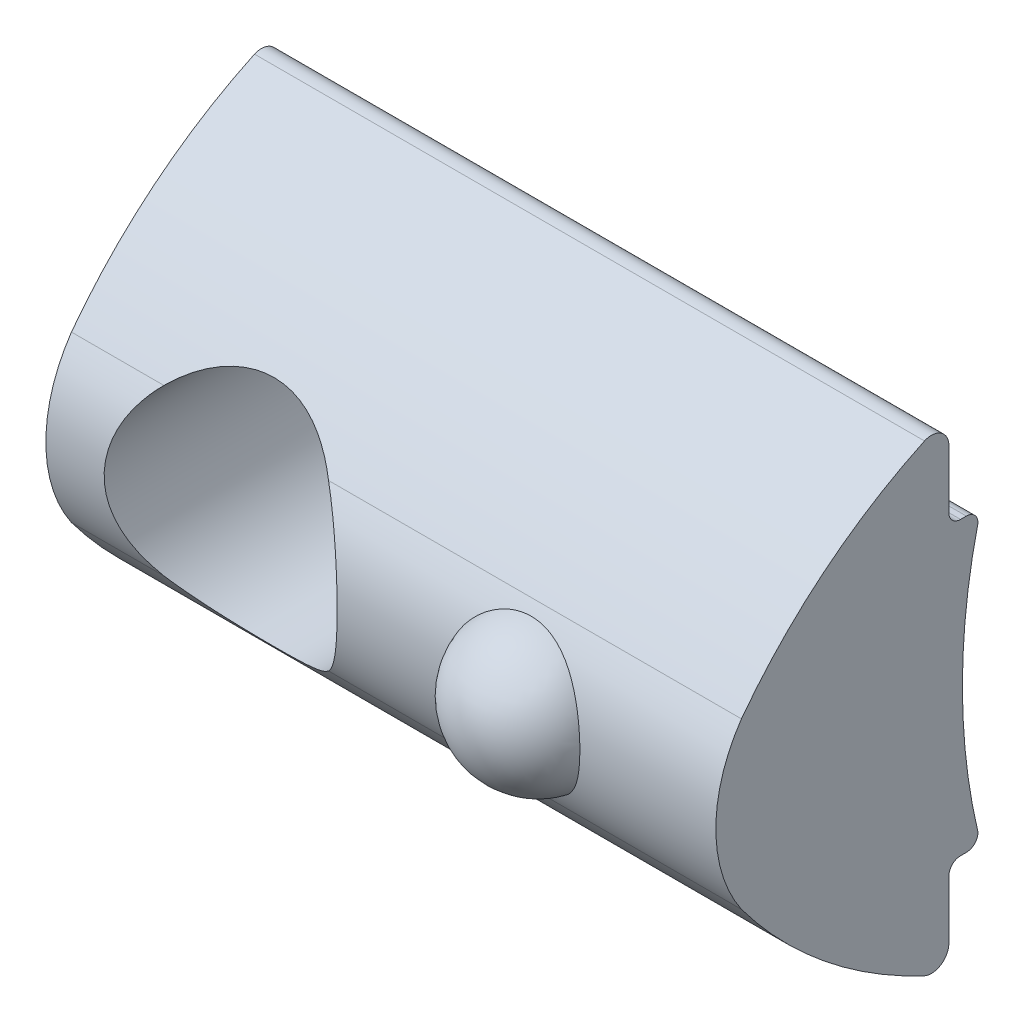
ISO-10303-21;
HEADER;
FILE_DESCRIPTION(('STEP AP214'),'2;1');
FILE_NAME('part.step','',(''),(''),'','','');
FILE_SCHEMA(('AUTOMOTIVE_DESIGN { 1 0 10303 214 1 1 1 1 }'));
ENDSEC;
DATA;
#1=APPLICATION_CONTEXT('core data for automotive mechanical design processes');
#2=APPLICATION_PROTOCOL_DEFINITION('international standard','automotive_design',2000,#1);
#3=PRODUCT_CONTEXT('',#1,'mechanical');
#4=PRODUCT('Part','Part','',(#3));
#5=PRODUCT_RELATED_PRODUCT_CATEGORY('part','',(#4));
#6=PRODUCT_DEFINITION_FORMATION('','',#4);
#7=PRODUCT_DEFINITION_CONTEXT('part definition',#1,'design');
#8=PRODUCT_DEFINITION('design','',#6,#7);
#9=PRODUCT_DEFINITION_SHAPE('','',#8);
#10=(LENGTH_UNIT() NAMED_UNIT(*) SI_UNIT(.MILLI.,.METRE.));
#11=(NAMED_UNIT(*) PLANE_ANGLE_UNIT() SI_UNIT($,.RADIAN.));
#12=(NAMED_UNIT(*) SI_UNIT($,.STERADIAN.) SOLID_ANGLE_UNIT());
#13=UNCERTAINTY_MEASURE_WITH_UNIT(LENGTH_MEASURE(1.E-05),#10,'distance_accuracy_value','');
#14=(GEOMETRIC_REPRESENTATION_CONTEXT(3) GLOBAL_UNCERTAINTY_ASSIGNED_CONTEXT((#13)) GLOBAL_UNIT_ASSIGNED_CONTEXT((#10,
#11,#12)) REPRESENTATION_CONTEXT('',''));
#15=CARTESIAN_POINT('',(0.,0.,0.));
#16=DIRECTION('',(0.,0.,1.));
#17=DIRECTION('',(1.,0.,0.));
#18=AXIS2_PLACEMENT_3D('',#15,#16,#17);
#19=CARTESIAN_POINT('',(8.5,1.17961196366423E-13,1.5000000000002));
#20=DIRECTION('',(-1.,0.,0.));
#21=DIRECTION('',(0.,1.,0.));
#22=AXIS2_PLACEMENT_3D('',#19,#20,#21);
#23=CYLINDRICAL_SURFACE('',#22,2.5);
#24=DIRECTION('',(-1.,0.,0.));
#25=VECTOR('',#24,1.);
#26=CARTESIAN_POINT('',(8.5,-1.41554648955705,3.56063779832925));
#27=LINE('',#26,#25);
#28=CARTESIAN_POINT('',(-1.41287937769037,-1.41554648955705,3.56063779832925));
#29=VERTEX_POINT('',#28);
#30=CARTESIAN_POINT('',(-3.,-1.41554648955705,3.56063779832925));
#31=VERTEX_POINT('',#30);
#32=EDGE_CURVE('E155',#29,#31,#27,.T.);
#33=ORIENTED_EDGE('',*,*,#32,.F.);
#34=CARTESIAN_POINT('',(-1.41287937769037,-1.41554648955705,3.56063779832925));
#35=CARTESIAN_POINT('',(-1.44943985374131,-1.37904113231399,3.58571280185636));
#36=CARTESIAN_POINT('',(-1.48471509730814,-1.34101538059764,3.61040711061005));
#37=CARTESIAN_POINT('',(-1.5525583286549,-1.26186190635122,3.65867122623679));
#38=CARTESIAN_POINT('',(-1.58512301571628,-1.22073051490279,3.68223964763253));
#39=CARTESIAN_POINT('',(-1.678779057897,-1.09222765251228,3.75088495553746));
#40=CARTESIAN_POINT('',(-1.73540310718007,-1.0001712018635,3.79360120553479));
#41=CARTESIAN_POINT('',(-1.82636478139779,-0.820297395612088,3.8632392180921));
#42=CARTESIAN_POINT('',(-1.86280818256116,-0.734097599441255,3.89158913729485));
#43=CARTESIAN_POINT('',(-1.92364463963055,-0.555388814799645,3.93927258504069));
#44=CARTESIAN_POINT('',(-1.94807293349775,-0.462899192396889,3.95863247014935));
#45=CARTESIAN_POINT('',(-1.98362135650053,-0.273158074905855,3.98689277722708));
#46=CARTESIAN_POINT('',(-1.99465414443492,-0.175879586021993,3.99572454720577));
#47=CARTESIAN_POINT('',(-2.00229419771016,0.0196619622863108,4.00183446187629));
#48=CARTESIAN_POINT('',(-1.99889661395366,0.117925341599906,3.99910872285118));
#49=CARTESIAN_POINT('',(-1.97894237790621,0.302644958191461,3.98318011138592));
#50=CARTESIAN_POINT('',(-1.96366790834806,0.389335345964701,3.97099828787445));
#51=CARTESIAN_POINT('',(-1.92242018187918,0.558461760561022,3.9383479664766));
#52=CARTESIAN_POINT('',(-1.89644686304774,0.64089776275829,3.91787942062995));
#53=CARTESIAN_POINT('',(-1.83332986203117,0.804366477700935,3.86868858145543));
#54=CARTESIAN_POINT('',(-1.79564782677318,0.885069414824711,3.83957240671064));
#55=CARTESIAN_POINT('',(-1.71118646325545,1.03901823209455,3.77539094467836));
#56=CARTESIAN_POINT('',(-1.66440121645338,1.11225921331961,3.74032178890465));
#57=CARTESIAN_POINT('',(-1.58293949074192,1.22352893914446,3.6806553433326));
#58=CARTESIAN_POINT('',(-1.55071565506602,1.26409726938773,3.65734892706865));
#59=CARTESIAN_POINT('',(-1.48369538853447,1.34211640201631,3.60969341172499));
#60=CARTESIAN_POINT('',(-1.44890787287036,1.37957712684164,3.58534803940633));
#61=CARTESIAN_POINT('',(-1.4128793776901,1.41554648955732,3.56063779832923));
#62=B_SPLINE_CURVE_WITH_KNOTS('',3,(#34,#35,#36,#37,#38,#39,#40,#41,#42,#43,#44,#45,#46,#47,#48,
#49,#50,#51,#52,#53,#54,#55,#56,#57,#58,#59,#60,#61),.UNSPECIFIED.,.F.,.F.,(4,2,2,2,2,2,2,2,2,2,
2,2,2,4),(0.,0.172205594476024,0.344617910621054,0.691443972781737,0.983621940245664,
1.27493781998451,1.568143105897,1.86144692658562,2.12685696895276,2.39226854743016,
2.67235932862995,2.95263282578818,3.12292431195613,3.29264926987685),.UNSPECIFIED.);
#63=CARTESIAN_POINT('',(-1.4128793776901,1.41554648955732,3.56063779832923));
#64=VERTEX_POINT('',#63);
#65=EDGE_CURVE('E35',#29,#64,#62,.T.);
#66=ORIENTED_EDGE('',*,*,#65,.T.);
#67=DIRECTION('',(-1.,0.,0.));
#68=VECTOR('',#67,1.);
#69=CARTESIAN_POINT('',(8.5,1.41554648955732,3.56063779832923));
#70=LINE('',#69,#68);
#71=CARTESIAN_POINT('',(-3.,1.41554648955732,3.56063779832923));
#72=VERTEX_POINT('',#71);
#73=EDGE_CURVE('E199',#64,#72,#70,.T.);
#74=ORIENTED_EDGE('',*,*,#73,.T.);
#75=CARTESIAN_POINT('',(-3.,1.17961196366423E-13,1.5000000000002));
#76=DIRECTION('',(1.,0.,0.));
#77=DIRECTION('',(0.,-1.,0.));
#78=AXIS2_PLACEMENT_3D('',#75,#76,#77);
#79=CIRCLE('',#78,2.5);
#80=EDGE_CURVE('E187',#72,#31,#79,.T.);
#81=ORIENTED_EDGE('',*,*,#80,.T.);
#82=EDGE_LOOP('',(#33,#66,#74,#81));
#83=FACE_BOUND('',#82,.T.);
#84=ADVANCED_FACE('F14',(#83),#23,.T.);
#85=CARTESIAN_POINT('',(8.5,-2.69999999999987,-0.199999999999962));
#86=DIRECTION('',(-1.,0.,0.));
#87=DIRECTION('',(0.,1.,0.));
#88=AXIS2_PLACEMENT_3D('',#85,#86,#87);
#89=CYLINDRICAL_SURFACE('',#88,0.2);
#90=CARTESIAN_POINT('',(-3.,-2.69999999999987,-0.199999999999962));
#91=DIRECTION('',(-1.,0.,0.));
#92=DIRECTION('',(0.,-1.,0.));
#93=AXIS2_PLACEMENT_3D('',#90,#91,#92);
#94=CIRCLE('',#93,0.2);
#95=CARTESIAN_POINT('',(-3.,-2.69999999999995,0.));
#96=VERTEX_POINT('',#95);
#97=CARTESIAN_POINT('',(-3.,-2.49999999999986,-0.199999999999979));
#98=VERTEX_POINT('',#97);
#99=EDGE_CURVE('E164',#96,#98,#94,.T.);
#100=ORIENTED_EDGE('',*,*,#99,.T.);
#101=DIRECTION('',(-1.,0.,0.));
#102=VECTOR('',#101,1.);
#103=CARTESIAN_POINT('',(8.5,-2.49999999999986,-0.199999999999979));
#104=LINE('',#103,#102);
#105=CARTESIAN_POINT('',(8.5,-2.49999999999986,-0.199999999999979));
#106=VERTEX_POINT('',#105);
#107=EDGE_CURVE('E28',#106,#98,#104,.T.);
#108=ORIENTED_EDGE('',*,*,#107,.F.);
#109=CARTESIAN_POINT('',(8.5,-2.69999999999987,-0.199999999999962));
#110=DIRECTION('',(-1.,0.,0.));
#111=DIRECTION('',(0.,-1.,0.));
#112=AXIS2_PLACEMENT_3D('',#109,#110,#111);
#113=CIRCLE('',#112,0.2);
#114=CARTESIAN_POINT('',(8.5,-2.69999999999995,0.));
#115=VERTEX_POINT('',#114);
#116=EDGE_CURVE('E194',#115,#106,#113,.T.);
#117=ORIENTED_EDGE('',*,*,#116,.F.);
#118=DIRECTION('',(-1.,0.,0.));
#119=VECTOR('',#118,1.);
#120=CARTESIAN_POINT('',(8.5,-2.69999999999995,0.));
#121=LINE('',#120,#119);
#122=EDGE_CURVE('E160',#115,#96,#121,.T.);
#123=ORIENTED_EDGE('',*,*,#122,.T.);
#124=EDGE_LOOP('',(#100,#108,#117,#123));
#125=FACE_BOUND('',#124,.T.);
#126=ADVANCED_FACE('F16',(#125),#89,.F.);
#127=CARTESIAN_POINT('',(8.5,-2.49999999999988,-0.299999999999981));
#128=DIRECTION('',(0.,1.,-1.45726178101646E-13));
#129=DIRECTION('',(0.,1.45726178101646E-13,1.));
#130=AXIS2_PLACEMENT_3D('',#127,#128,#129);
#131=PLANE('',#130);
#132=DIRECTION('',(0.,-1.45726178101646E-13,-1.));
#133=VECTOR('',#132,1.);
#134=CARTESIAN_POINT('',(-3.,-2.49999999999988,-0.299999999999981));
#135=LINE('',#134,#133);
#136=CARTESIAN_POINT('',(-3.,-2.49999999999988,-0.299999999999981));
#137=VERTEX_POINT('',#136);
#138=EDGE_CURVE('E167',#98,#137,#135,.T.);
#139=ORIENTED_EDGE('',*,*,#138,.T.);
#140=DIRECTION('',(-1.,0.,0.));
#141=VECTOR('',#140,1.);
#142=CARTESIAN_POINT('',(8.5,-2.49999999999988,-0.299999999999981));
#143=LINE('',#142,#141);
#144=CARTESIAN_POINT('',(8.5,-2.49999999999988,-0.299999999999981));
#145=VERTEX_POINT('',#144);
#146=EDGE_CURVE('E224',#145,#137,#143,.T.);
#147=ORIENTED_EDGE('',*,*,#146,.F.);
#148=DIRECTION('',(0.,-1.45726178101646E-13,-1.));
#149=VECTOR('',#148,1.);
#150=CARTESIAN_POINT('',(8.5,-2.49999999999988,-0.299999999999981));
#151=LINE('',#150,#149);
#152=EDGE_CURVE('E103',#106,#145,#151,.T.);
#153=ORIENTED_EDGE('',*,*,#152,.F.);
#154=ORIENTED_EDGE('',*,*,#107,.T.);
#155=EDGE_LOOP('',(#139,#147,#153,#154));
#156=FACE_BOUND('',#155,.T.);
#157=ADVANCED_FACE('F305',(#156),#131,.F.);
#158=CARTESIAN_POINT('',(8.5,-2.29999999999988,-0.29999999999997));
#159=DIRECTION('',(-1.,0.,0.));
#160=DIRECTION('',(0.,1.,0.));
#161=AXIS2_PLACEMENT_3D('',#158,#159,#160);
#162=CYLINDRICAL_SURFACE('',#161,0.2);
#163=CARTESIAN_POINT('',(-3.,-2.29999999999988,-0.29999999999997));
#164=DIRECTION('',(1.,0.,0.));
#165=DIRECTION('',(0.,-1.,0.));
#166=AXIS2_PLACEMENT_3D('',#163,#164,#165);
#167=CIRCLE('',#166,0.2);
#168=CARTESIAN_POINT('',(-3.,-2.29999999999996,-0.499999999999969));
#169=VERTEX_POINT('',#168);
#170=EDGE_CURVE('E170',#137,#169,#167,.T.);
#171=ORIENTED_EDGE('',*,*,#170,.T.);
#172=DIRECTION('',(-1.,0.,0.));
#173=VECTOR('',#172,1.);
#174=CARTESIAN_POINT('',(8.5,-2.29999999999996,-0.499999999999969));
#175=LINE('',#174,#173);
#176=CARTESIAN_POINT('',(8.5,-2.29999999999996,-0.499999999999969));
#177=VERTEX_POINT('',#176);
#178=EDGE_CURVE('E221',#177,#169,#175,.T.);
#179=ORIENTED_EDGE('',*,*,#178,.F.);
#180=CARTESIAN_POINT('',(8.5,-2.29999999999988,-0.29999999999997));
#181=DIRECTION('',(1.,0.,0.));
#182=DIRECTION('',(0.,-1.,0.));
#183=AXIS2_PLACEMENT_3D('',#180,#181,#182);
#184=CIRCLE('',#183,0.2);
#185=EDGE_CURVE('E343',#145,#177,#184,.T.);
#186=ORIENTED_EDGE('',*,*,#185,.F.);
#187=ORIENTED_EDGE('',*,*,#146,.T.);
#188=EDGE_LOOP('',(#171,#179,#186,#187));
#189=FACE_BOUND('',#188,.T.);
#190=ADVANCED_FACE('F302',(#189),#162,.T.);
#191=CARTESIAN_POINT('',(8.5,0.,-10.2319062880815));
#192=DIRECTION('',(-1.,0.,0.));
#193=DIRECTION('',(0.,1.,0.));
#194=AXIS2_PLACEMENT_3D('',#191,#192,#193);
#195=CYLINDRICAL_SURFACE('',#194,10.);
#196=CARTESIAN_POINT('',(0.,2.,-0.433947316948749));
#197=CARTESIAN_POINT('',(-0.111128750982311,1.99999589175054,-0.433945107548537));
#198=CARTESIAN_POINT('',(-0.222309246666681,1.99070634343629,-0.43203612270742));
#199=CARTESIAN_POINT('',(-0.441525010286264,1.95382456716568,-0.424617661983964));
#200=CARTESIAN_POINT('',(-0.54955768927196,1.92621769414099,-0.419105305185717));
#201=CARTESIAN_POINT('',(-0.759274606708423,1.85359156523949,-0.405128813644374));
#202=CARTESIAN_POINT('',(-0.86096504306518,1.80858962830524,-0.396667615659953));
#203=CARTESIAN_POINT('',(-1.05534968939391,1.70249821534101,-0.377750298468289));
#204=CARTESIAN_POINT('',(-1.14804440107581,1.6414096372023,-0.367294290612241));
#205=CARTESIAN_POINT('',(-1.32312200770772,1.50395815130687,-0.34540029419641));
#206=CARTESIAN_POINT('',(-1.40535917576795,1.42741131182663,-0.33395153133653));
#207=CARTESIAN_POINT('',(-1.55591506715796,1.26161357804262,-0.31145684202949));
#208=CARTESIAN_POINT('',(-1.62423281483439,1.17236179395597,-0.300410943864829));
#209=CARTESIAN_POINT('',(-1.74557603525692,0.982722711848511,-0.279850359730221));
#210=CARTESIAN_POINT('',(-1.79846302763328,0.882245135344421,-0.270349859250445));
#211=CARTESIAN_POINT('',(-1.88654987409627,0.673608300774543,-0.254071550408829));
#212=CARTESIAN_POINT('',(-1.92175138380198,0.565449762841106,-0.247293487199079));
#213=CARTESIAN_POINT('',(-1.97301438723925,0.346033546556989,-0.237299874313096));
#214=CARTESIAN_POINT('',(-1.98932195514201,0.234835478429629,-0.23403856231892));
#215=CARTESIAN_POINT('',(-2.00310190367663,0.0112371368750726,-0.231287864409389));
#216=CARTESIAN_POINT('',(-2.00057609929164,-0.101163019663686,-0.231798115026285));
#217=CARTESIAN_POINT('',(-1.97694763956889,-0.322284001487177,-0.236497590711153));
#218=CARTESIAN_POINT('',(-1.9561100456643,-0.431034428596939,-0.240634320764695));
#219=CARTESIAN_POINT('',(-1.89686993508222,-0.643463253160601,-0.252062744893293));
#220=CARTESIAN_POINT('',(-1.85846671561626,-0.747141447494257,-0.259354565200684));
#221=CARTESIAN_POINT('',(-1.76493991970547,-0.947238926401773,-0.276360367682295));
#222=CARTESIAN_POINT('',(-1.70971249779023,-1.0436083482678,-0.28608932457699));
#223=CARTESIAN_POINT('',(-1.5841818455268,-1.22581009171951,-0.306896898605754));
#224=CARTESIAN_POINT('',(-1.51387688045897,-1.31164119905,-0.317975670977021));
#225=CARTESIAN_POINT('',(-1.35873275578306,-1.47190286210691,-0.340487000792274));
#226=CARTESIAN_POINT('',(-1.27366162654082,-1.54610863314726,-0.351922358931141));
#227=CARTESIAN_POINT('',(-1.0921671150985,-1.67923698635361,-0.373674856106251));
#228=CARTESIAN_POINT('',(-0.995743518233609,-1.7381592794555,-0.383991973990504));
#229=CARTESIAN_POINT('',(-0.79395833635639,-1.83912562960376,-0.402345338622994));
#230=CARTESIAN_POINT('',(-0.688578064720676,-1.88113329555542,-0.410376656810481));
#231=CARTESIAN_POINT('',(-0.472057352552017,-1.94678068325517,-0.423176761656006));
#232=CARTESIAN_POINT('',(-0.360917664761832,-1.97042279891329,-0.427945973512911));
#233=CARTESIAN_POINT('',(-0.138070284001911,-1.9983320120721,-0.433596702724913));
#234=CARTESIAN_POINT('',(-0.026404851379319,-2.00292371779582,-0.434543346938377));
#235=CARTESIAN_POINT('',(0.196096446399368,-1.99347525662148,-0.432616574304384));
#236=CARTESIAN_POINT('',(0.306932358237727,-1.97943614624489,-0.429743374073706));
#237=CARTESIAN_POINT('',(0.523537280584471,-1.93340441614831,-0.420561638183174));
#238=CARTESIAN_POINT('',(0.629344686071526,-1.9015852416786,-0.414286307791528));
#239=CARTESIAN_POINT('',(0.834126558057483,-1.82108207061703,-0.399036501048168));
#240=CARTESIAN_POINT('',(0.933100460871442,-1.77239668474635,-0.390061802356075));
#241=CARTESIAN_POINT('',(1.12282621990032,-1.6588082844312,-0.370278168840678));
#242=CARTESIAN_POINT('',(1.21345409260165,-1.59370215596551,-0.359446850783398));
#243=CARTESIAN_POINT('',(1.38261662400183,-1.44939114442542,-0.337231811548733));
#244=CARTESIAN_POINT('',(1.46115003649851,-1.37018481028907,-0.325848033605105));
#245=CARTESIAN_POINT('',(1.60512511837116,-1.19846454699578,-0.303599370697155));
#246=CARTESIAN_POINT('',(1.67034730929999,-1.10576499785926,-0.292745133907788));
#247=CARTESIAN_POINT('',(1.78429176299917,-0.910535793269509,-0.272963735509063));
#248=CARTESIAN_POINT('',(1.83301471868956,-0.808006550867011,-0.264036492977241));
#249=CARTESIAN_POINT('',(1.91225774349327,-0.596605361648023,-0.249160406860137));
#250=CARTESIAN_POINT('',(1.94288103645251,-0.487773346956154,-0.243194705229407));
#251=CARTESIAN_POINT('',(1.98538249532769,-0.266378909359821,-0.234841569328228));
#252=CARTESIAN_POINT('',(1.99726291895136,-0.153816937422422,-0.232453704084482));
#253=CARTESIAN_POINT('',(2.00185396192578,0.0697457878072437,-0.231535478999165));
#254=CARTESIAN_POINT('',(1.99489456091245,0.180739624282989,-0.232938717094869));
#255=CARTESIAN_POINT('',(1.96273209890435,0.399942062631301,-0.239305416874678));
#256=CARTESIAN_POINT('',(1.93752926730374,0.508150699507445,-0.244268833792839));
#257=CARTESIAN_POINT('',(1.86974201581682,0.71850549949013,-0.257196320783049));
#258=CARTESIAN_POINT('',(1.82719724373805,0.820664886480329,-0.265153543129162));
#259=CARTESIAN_POINT('',(1.72597551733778,1.01644244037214,-0.283211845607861));
#260=CARTESIAN_POINT('',(1.667297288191,1.11005993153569,-0.293313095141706));
#261=CARTESIAN_POINT('',(1.53436122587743,1.28772778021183,-0.314754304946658));
#262=CARTESIAN_POINT('',(1.45986732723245,1.37159943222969,-0.326111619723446));
#263=CARTESIAN_POINT('',(1.29789951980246,1.52576523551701,-0.348681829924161));
#264=CARTESIAN_POINT('',(1.21042254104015,1.59605616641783,-0.359894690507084));
#265=CARTESIAN_POINT('',(1.02384136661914,1.72178443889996,-0.381039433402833));
#266=CARTESIAN_POINT('',(0.924622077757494,1.77705362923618,-0.390956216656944));
#267=CARTESIAN_POINT('',(0.718134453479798,1.87004809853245,-0.4082015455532));
#268=CARTESIAN_POINT('',(0.610873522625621,1.90778929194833,-0.415532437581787));
#269=CARTESIAN_POINT('',(0.419475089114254,1.95733827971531,-0.425312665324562));
#270=CARTESIAN_POINT('',(0.336429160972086,1.97330779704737,-0.428530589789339));
#271=CARTESIAN_POINT('',(0.168932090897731,1.99464003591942,-0.432848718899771));
#272=CARTESIAN_POINT('',(0.0844809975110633,2.00000312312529,-0.433948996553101));
#273=CARTESIAN_POINT('',(0.,2.,-0.433947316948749));
#274=B_SPLINE_CURVE_WITH_KNOTS('',3,(#196,#197,#198,#199,#200,#201,#202,#203,#204,#205,#206,
#207,#208,#209,#210,#211,#212,#213,#214,#215,#216,#217,#218,#219,#220,#221,#222,#223,#224,#225,
#226,#227,#228,#229,#230,#231,#232,#233,#234,#235,#236,#237,#238,#239,#240,#241,#242,#243,#244,
#245,#246,#247,#248,#249,#250,#251,#252,#253,#254,#255,#256,#257,#258,#259,#260,#261,#262,#263,
#264,#265,#266,#267,#268,#269,#270,#271,#272,#273),.UNSPECIFIED.,.T.,.F.,(4,2,2,2,2,2,2,2,2,2,2,
2,2,2,2,2,2,2,2,2,2,2,2,2,2,2,2,2,2,2,2,2,2,2,2,2,2,2,4),(0.,0.333076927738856,
0.666420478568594,0.999432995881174,1.33242692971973,1.66964505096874,2.00688680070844,
2.347068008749,2.68721736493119,3.02288497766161,3.35852024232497,3.68937579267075,
4.020244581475,4.35319848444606,4.68619071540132,5.02498693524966,5.3637895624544,
5.70331726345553,6.04280070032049,6.37647515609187,6.71013069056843,7.04058683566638,
7.37107020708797,7.70586119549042,8.04068665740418,8.38065203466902,8.7206031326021,
9.058596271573,9.39654869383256,9.72862034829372,10.0606878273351,10.392000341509,
10.7233390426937,11.0600230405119,11.3967867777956,11.7371779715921,12.077259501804,
12.3304760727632,12.5836839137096),.UNSPECIFIED.);
#275=CARTESIAN_POINT('',(0.,2.,-0.433947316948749));
#276=VERTEX_POINT('',#275);
#277=EDGE_CURVE('E168',#276,#276,#274,.T.);
#278=ORIENTED_EDGE('',*,*,#277,.T.);
#279=EDGE_LOOP('',(#278));
#280=FACE_BOUND('',#279,.T.);
#281=CARTESIAN_POINT('',(-3.,0.,-10.2319062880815));
#282=DIRECTION('',(-1.,0.,0.));
#283=DIRECTION('',(0.,-1.,0.));
#284=AXIS2_PLACEMENT_3D('',#281,#282,#283);
#285=CIRCLE('',#284,10.);
#286=CARTESIAN_POINT('',(-3.,2.29999999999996,-0.499999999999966));
#287=VERTEX_POINT('',#286);
#288=EDGE_CURVE('E172',#169,#287,#285,.T.);
#289=ORIENTED_EDGE('',*,*,#288,.T.);
#290=DIRECTION('',(-1.,0.,0.));
#291=VECTOR('',#290,1.);
#292=CARTESIAN_POINT('',(8.5,2.29999999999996,-0.499999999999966));
#293=LINE('',#292,#291);
#294=CARTESIAN_POINT('',(8.5,2.29999999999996,-0.499999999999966));
#295=VERTEX_POINT('',#294);
#296=EDGE_CURVE('E218',#295,#287,#293,.T.);
#297=ORIENTED_EDGE('',*,*,#296,.F.);
#298=CARTESIAN_POINT('',(8.5,0.,-10.2319062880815));
#299=DIRECTION('',(-1.,0.,0.));
#300=DIRECTION('',(0.,-1.,0.));
#301=AXIS2_PLACEMENT_3D('',#298,#299,#300);
#302=CIRCLE('',#301,10.);
#303=EDGE_CURVE('E347',#177,#295,#302,.T.);
#304=ORIENTED_EDGE('',*,*,#303,.F.);
#305=ORIENTED_EDGE('',*,*,#178,.T.);
#306=EDGE_LOOP('',(#289,#297,#304,#305));
#307=FACE_BOUND('',#306,.T.);
#308=ADVANCED_FACE('F297',(#280,#307),#195,.F.);
#309=CARTESIAN_POINT('',(8.5,2.30000000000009,-0.299999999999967));
#310=DIRECTION('',(-1.,0.,0.));
#311=DIRECTION('',(0.,1.,0.));
#312=AXIS2_PLACEMENT_3D('',#309,#310,#311);
#313=CYLINDRICAL_SURFACE('',#312,0.2);
#314=CARTESIAN_POINT('',(-3.,2.30000000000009,-0.299999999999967));
#315=DIRECTION('',(1.,0.,0.));
#316=DIRECTION('',(0.,-1.,0.));
#317=AXIS2_PLACEMENT_3D('',#314,#315,#316);
#318=CIRCLE('',#317,0.2);
#319=CARTESIAN_POINT('',(-3.,2.5000000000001,-0.3));
#320=VERTEX_POINT('',#319);
#321=EDGE_CURVE('E174',#287,#320,#318,.T.);
#322=ORIENTED_EDGE('',*,*,#321,.T.);
#323=DIRECTION('',(-1.,0.,0.));
#324=VECTOR('',#323,1.);
#325=CARTESIAN_POINT('',(8.5,2.5000000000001,-0.3));
#326=LINE('',#325,#324);
#327=CARTESIAN_POINT('',(8.5,2.5000000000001,-0.3));
#328=VERTEX_POINT('',#327);
#329=EDGE_CURVE('E215',#328,#320,#326,.T.);
#330=ORIENTED_EDGE('',*,*,#329,.F.);
#331=CARTESIAN_POINT('',(8.5,2.30000000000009,-0.299999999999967));
#332=DIRECTION('',(1.,0.,0.));
#333=DIRECTION('',(0.,-1.,0.));
#334=AXIS2_PLACEMENT_3D('',#331,#332,#333);
#335=CIRCLE('',#334,0.2);
#336=EDGE_CURVE('E349',#295,#328,#335,.T.);
#337=ORIENTED_EDGE('',*,*,#336,.F.);
#338=ORIENTED_EDGE('',*,*,#296,.T.);
#339=EDGE_LOOP('',(#322,#330,#337,#338));
#340=FACE_BOUND('',#339,.T.);
#341=ADVANCED_FACE('F294',(#340),#313,.T.);
#342=CARTESIAN_POINT('',(8.5,2.5000000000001,-0.3));
#343=DIRECTION('',(0.,-1.,-1.49176812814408E-13));
#344=DIRECTION('',(0.,1.49176812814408E-13,-1.));
#345=AXIS2_PLACEMENT_3D('',#342,#343,#344);
#346=PLANE('',#345);
#347=DIRECTION('',(0.,-1.49176812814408E-13,1.));
#348=VECTOR('',#347,1.);
#349=CARTESIAN_POINT('',(-3.,2.5000000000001,-0.3));
#350=LINE('',#349,#348);
#351=CARTESIAN_POINT('',(-3.,2.50000000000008,-0.2));
#352=VERTEX_POINT('',#351);
#353=EDGE_CURVE('E176',#320,#352,#350,.T.);
#354=ORIENTED_EDGE('',*,*,#353,.T.);
#355=DIRECTION('',(-1.,0.,0.));
#356=VECTOR('',#355,1.);
#357=CARTESIAN_POINT('',(8.5,2.50000000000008,-0.2));
#358=LINE('',#357,#356);
#359=CARTESIAN_POINT('',(8.5,2.50000000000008,-0.2));
#360=VERTEX_POINT('',#359);
#361=EDGE_CURVE('E212',#360,#352,#358,.T.);
#362=ORIENTED_EDGE('',*,*,#361,.F.);
#363=DIRECTION('',(0.,-1.49176812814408E-13,1.));
#364=VECTOR('',#363,1.);
#365=CARTESIAN_POINT('',(8.5,2.5000000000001,-0.3));
#366=LINE('',#365,#364);
#367=EDGE_CURVE('E351',#328,#360,#366,.T.);
#368=ORIENTED_EDGE('',*,*,#367,.F.);
#369=ORIENTED_EDGE('',*,*,#329,.T.);
#370=EDGE_LOOP('',(#354,#362,#368,#369));
#371=FACE_BOUND('',#370,.T.);
#372=ADVANCED_FACE('F290',(#371),#346,.F.);
#373=CARTESIAN_POINT('',(8.5,2.70000000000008,-0.2));
#374=DIRECTION('',(-1.,0.,0.));
#375=DIRECTION('',(0.,1.,0.));
#376=AXIS2_PLACEMENT_3D('',#373,#374,#375);
#377=CYLINDRICAL_SURFACE('',#376,0.2);
#378=CARTESIAN_POINT('',(-3.,2.70000000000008,-0.2));
#379=DIRECTION('',(-1.,0.,0.));
#380=DIRECTION('',(0.,-1.,0.));
#381=AXIS2_PLACEMENT_3D('',#378,#379,#380);
#382=CIRCLE('',#381,0.2);
#383=CARTESIAN_POINT('',(-3.,2.70000000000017,0.));
#384=VERTEX_POINT('',#383);
#385=EDGE_CURVE('E178',#352,#384,#382,.T.);
#386=ORIENTED_EDGE('',*,*,#385,.T.);
#387=DIRECTION('',(-1.,0.,0.));
#388=VECTOR('',#387,1.);
#389=CARTESIAN_POINT('',(8.5,2.70000000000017,0.));
#390=LINE('',#389,#388);
#391=CARTESIAN_POINT('',(8.5,2.70000000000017,0.));
#392=VERTEX_POINT('',#391);
#393=EDGE_CURVE('E209',#392,#384,#390,.T.);
#394=ORIENTED_EDGE('',*,*,#393,.F.);
#395=CARTESIAN_POINT('',(8.5,2.70000000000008,-0.2));
#396=DIRECTION('',(-1.,0.,0.));
#397=DIRECTION('',(0.,-1.,0.));
#398=AXIS2_PLACEMENT_3D('',#395,#396,#397);
#399=CIRCLE('',#398,0.2);
#400=EDGE_CURVE('E353',#360,#392,#399,.T.);
#401=ORIENTED_EDGE('',*,*,#400,.F.);
#402=ORIENTED_EDGE('',*,*,#361,.T.);
#403=EDGE_LOOP('',(#386,#394,#401,#402));
#404=FACE_BOUND('',#403,.T.);
#405=ADVANCED_FACE('F286',(#404),#377,.F.);
#406=CARTESIAN_POINT('',(8.5,3.70000000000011,0.));
#407=DIRECTION('',(0.,0.,1.));
#408=DIRECTION('',(0.,-1.,0.));
#409=AXIS2_PLACEMENT_3D('',#406,#407,#408);
#410=PLANE('',#409);
#411=DIRECTION('',(0.,1.,0.));
#412=VECTOR('',#411,1.);
#413=CARTESIAN_POINT('',(-3.,3.70000000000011,0.));
#414=LINE('',#413,#412);
#415=CARTESIAN_POINT('',(-3.,3.70000000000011,0.));
#416=VERTEX_POINT('',#415);
#417=EDGE_CURVE('E180',#384,#416,#414,.T.);
#418=ORIENTED_EDGE('',*,*,#417,.T.);
#419=DIRECTION('',(-1.,0.,0.));
#420=VECTOR('',#419,1.);
#421=CARTESIAN_POINT('',(8.5,3.70000000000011,0.));
#422=LINE('',#421,#420);
#423=CARTESIAN_POINT('',(8.5,3.70000000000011,0.));
#424=VERTEX_POINT('',#423);
#425=EDGE_CURVE('E206',#424,#416,#422,.T.);
#426=ORIENTED_EDGE('',*,*,#425,.F.);
#427=DIRECTION('',(0.,1.,0.));
#428=VECTOR('',#427,1.);
#429=CARTESIAN_POINT('',(8.5,3.70000000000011,0.));
#430=LINE('',#429,#428);
#431=EDGE_CURVE('E355',#392,#424,#430,.T.);
#432=ORIENTED_EDGE('',*,*,#431,.F.);
#433=ORIENTED_EDGE('',*,*,#393,.T.);
#434=EDGE_LOOP('',(#418,#426,#432,#433));
#435=FACE_BOUND('',#434,.T.);
#436=ADVANCED_FACE('F282',(#435),#410,.F.);
#437=CARTESIAN_POINT('',(8.5,3.7000000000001,0.3));
#438=DIRECTION('',(-1.,0.,0.));
#439=DIRECTION('',(0.,1.,0.));
#440=AXIS2_PLACEMENT_3D('',#437,#438,#439);
#441=CYLINDRICAL_SURFACE('',#440,0.3);
#442=CARTESIAN_POINT('',(-3.,3.7000000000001,0.3));
#443=DIRECTION('',(1.,0.,0.));
#444=DIRECTION('',(0.,-1.,0.));
#445=AXIS2_PLACEMENT_3D('',#442,#443,#444);
#446=CIRCLE('',#445,0.3);
#447=CARTESIAN_POINT('',(-3.,3.97566587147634,0.418356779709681));
#448=VERTEX_POINT('',#447);
#449=EDGE_CURVE('E182',#416,#448,#446,.T.);
#450=ORIENTED_EDGE('',*,*,#449,.T.);
#451=DIRECTION('',(-1.,0.,0.));
#452=VECTOR('',#451,1.);
#453=CARTESIAN_POINT('',(8.5,3.97566587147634,0.418356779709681));
#454=LINE('',#453,#452);
#455=CARTESIAN_POINT('',(8.5,3.97566587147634,0.418356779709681));
#456=VERTEX_POINT('',#455);
#457=EDGE_CURVE('E203',#456,#448,#454,.T.);
#458=ORIENTED_EDGE('',*,*,#457,.F.);
#459=CARTESIAN_POINT('',(8.5,3.7000000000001,0.3));
#460=DIRECTION('',(1.,0.,0.));
#461=DIRECTION('',(0.,-1.,0.));
#462=AXIS2_PLACEMENT_3D('',#459,#460,#461);
#463=CIRCLE('',#462,0.3);
#464=EDGE_CURVE('E357',#424,#456,#463,.T.);
#465=ORIENTED_EDGE('',*,*,#464,.F.);
#466=ORIENTED_EDGE('',*,*,#425,.T.);
#467=EDGE_LOOP('',(#450,#458,#465,#466));
#468=FACE_BOUND('',#467,.T.);
#469=ADVANCED_FACE('F277',(#468),#441,.T.);
#470=CARTESIAN_POINT('',(8.5,-3.58328851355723,-3.12612410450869));
#471=DIRECTION('',(-1.,0.,0.));
#472=DIRECTION('',(0.,1.,0.));
#473=AXIS2_PLACEMENT_3D('',#470,#471,#472);
#474=CYLINDRICAL_SURFACE('',#473,8.34872062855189);
#475=ORIENTED_EDGE('',*,*,#73,.F.);
#476=CARTESIAN_POINT('',(-1.4128793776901,1.41554648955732,3.56063779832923));
#477=CARTESIAN_POINT('',(-1.34014234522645,1.48813341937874,3.50643164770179));
#478=CARTESIAN_POINT('',(-1.26090502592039,1.55602888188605,3.45377137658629));
#479=CARTESIAN_POINT('',(-1.08945829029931,1.68060417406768,3.35452258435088));
#480=CARTESIAN_POINT('',(-0.997142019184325,1.73718129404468,3.30799087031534));
#481=CARTESIAN_POINT('',(-0.818964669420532,1.82682979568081,3.23269422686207));
#482=CARTESIAN_POINT('',(-0.735055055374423,1.86231208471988,3.20223527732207));
#483=CARTESIAN_POINT('',(-0.560875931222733,1.92193989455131,3.15043177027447));
#484=CARTESIAN_POINT('',(-0.470628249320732,1.94612232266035,3.129057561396));
#485=CARTESIAN_POINT('',(-0.284898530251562,1.98187712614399,3.09727258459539));
#486=CARTESIAN_POINT('',(-0.189378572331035,1.99334074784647,3.08695639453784));
#487=CARTESIAN_POINT('',(0.00287974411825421,2.00230916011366,3.07889647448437));
#488=CARTESIAN_POINT('',(0.0996181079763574,1.9998138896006,3.08115279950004));
#489=CARTESIAN_POINT('',(0.279068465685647,1.98223637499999,3.09691123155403));
#490=CARTESIAN_POINT('',(0.362066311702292,1.96870661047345,3.10902589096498));
#491=CARTESIAN_POINT('',(0.524149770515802,1.93188578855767,3.14161778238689));
#492=CARTESIAN_POINT('',(0.603233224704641,1.90858941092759,3.16209957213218));
#493=CARTESIAN_POINT('',(0.779388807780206,1.84493827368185,3.21719905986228));
#494=CARTESIAN_POINT('',(0.874605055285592,1.80154920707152,3.25422210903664));
#495=CARTESIAN_POINT('',(1.05453063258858,1.70251066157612,3.33650646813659));
#496=CARTESIAN_POINT('',(1.13922643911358,1.6468456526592,3.38177820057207));
#497=CARTESIAN_POINT('',(1.25294883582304,1.559496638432,3.45065745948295));
#498=CARTESIAN_POINT('',(1.28652736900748,1.53190065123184,3.47215366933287));
#499=CARTESIAN_POINT('',(1.35138096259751,1.47499803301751,3.51587517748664));
#500=CARTESIAN_POINT('',(1.38266536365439,1.44569932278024,3.53809691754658));
#501=CARTESIAN_POINT('',(1.4128793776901,1.41554648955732,3.56063779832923));
#502=B_SPLINE_CURVE_WITH_KNOTS('',3,(#476,#477,#478,#479,#480,#481,#482,#483,#484,#485,#486,
#487,#488,#489,#490,#491,#492,#493,#494,#495,#496,#497,#498,#499,#500,#501),.UNSPECIFIED.,.F.,
.F.,(4,2,2,2,2,2,2,2,2,2,2,2,4),(0.,0.348930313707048,0.700896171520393,0.987924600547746,
1.27400887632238,1.56252093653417,1.85103425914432,2.10479228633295,2.35868872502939,
2.68990332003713,3.02153935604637,3.16693454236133,3.31170044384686),.UNSPECIFIED.);
#503=CARTESIAN_POINT('',(1.4128793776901,1.41554648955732,3.56063779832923));
#504=VERTEX_POINT('',#503);
#505=EDGE_CURVE('E260',#64,#504,#502,.T.);
#506=ORIENTED_EDGE('',*,*,#505,.T.);
#507=CARTESIAN_POINT('',(8.5,1.41554648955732,3.56063779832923));
#508=VERTEX_POINT('',#507);
#509=EDGE_CURVE('E200',#508,#504,#70,.T.);
#510=ORIENTED_EDGE('',*,*,#509,.F.);
#511=CARTESIAN_POINT('',(8.5,-3.58328851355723,-3.12612410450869));
#512=DIRECTION('',(1.,0.,0.));
#513=DIRECTION('',(0.,-1.,0.));
#514=AXIS2_PLACEMENT_3D('',#511,#512,#513);
#515=CIRCLE('',#514,8.34872062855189);
#516=EDGE_CURVE('E333',#456,#508,#515,.T.);
#517=ORIENTED_EDGE('',*,*,#516,.F.);
#518=ORIENTED_EDGE('',*,*,#457,.T.);
#519=CARTESIAN_POINT('',(-3.,-3.58328851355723,-3.12612410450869));
#520=DIRECTION('',(1.,0.,0.));
#521=DIRECTION('',(0.,-1.,0.));
#522=AXIS2_PLACEMENT_3D('',#519,#520,#521);
#523=CIRCLE('',#522,8.34872062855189);
#524=EDGE_CURVE('E184',#448,#72,#523,.T.);
#525=ORIENTED_EDGE('',*,*,#524,.T.);
#526=EDGE_LOOP('',(#475,#506,#510,#517,#518,#525));
#527=FACE_BOUND('',#526,.T.);
#528=ADVANCED_FACE('F272',(#527),#474,.T.);
#529=CARTESIAN_POINT('',(6.16619037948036,4.1286418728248E-13,4.00000000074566));
#530=CARTESIAN_POINT('',(6.16618826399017,-0.0698635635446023,3.99999625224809));
#531=CARTESIAN_POINT('',(6.161030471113,-0.139786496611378,3.99704452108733));
#532=CARTESIAN_POINT('',(6.1404544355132,-0.277693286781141,3.98549606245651));
#533=CARTESIAN_POINT('',(6.12502188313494,-0.345674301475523,3.97689146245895));
#534=CARTESIAN_POINT('',(6.08412407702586,-0.477654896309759,3.95485559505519));
#535=CARTESIAN_POINT('',(6.05866838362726,-0.541658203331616,3.94142892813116));
#536=CARTESIAN_POINT('',(5.99808409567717,-0.663979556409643,3.91103823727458));
#537=CARTESIAN_POINT('',(5.96295706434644,-0.722298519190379,3.89407478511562));
#538=CARTESIAN_POINT('',(5.88331193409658,-0.831992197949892,3.8582068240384));
#539=CARTESIAN_POINT('',(5.83874284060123,-0.883326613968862,3.83929207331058));
#540=CARTESIAN_POINT('',(5.74105305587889,-0.977217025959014,3.80165366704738));
#541=CARTESIAN_POINT('',(5.68793216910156,-1.0197728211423,3.78293001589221));
#542=CARTESIAN_POINT('',(5.57579939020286,-1.0937383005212,3.74841323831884));
#543=CARTESIAN_POINT('',(5.51699028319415,-1.1254229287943,3.73255355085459));
#544=CARTESIAN_POINT('',(5.3938352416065,-1.17812160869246,3.70520292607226));
#545=CARTESIAN_POINT('',(5.32949379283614,-1.19914421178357,3.69370848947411));
#546=CARTESIAN_POINT('',(5.20325121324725,-1.2283386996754,3.67748457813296));
#547=CARTESIAN_POINT('',(5.14164122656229,-1.23748644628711,3.6722447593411));
#548=CARTESIAN_POINT('',(5.01754011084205,-1.24590176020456,3.66743069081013));
#549=CARTESIAN_POINT('',(4.95504939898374,-1.24517385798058,3.66785384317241));
#550=CARTESIAN_POINT('',(4.83571989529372,-1.23428489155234,3.67406800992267));
#551=CARTESIAN_POINT('',(4.77879673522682,-1.22480281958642,3.67947260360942));
#552=CARTESIAN_POINT('',(4.66752247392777,-1.19767059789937,3.69449842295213));
#553=CARTESIAN_POINT('',(4.61317158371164,-1.18001977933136,3.70411999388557));
#554=CARTESIAN_POINT('',(4.5070743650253,-1.13654937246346,3.72685140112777));
#555=CARTESIAN_POINT('',(4.45542042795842,-1.11054590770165,3.74003858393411));
#556=CARTESIAN_POINT('',(4.35715855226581,-1.05119697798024,3.7684941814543));
#557=CARTESIAN_POINT('',(4.31055229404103,-1.01784907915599,3.78376328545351));
#558=CARTESIAN_POINT('',(4.21924598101,-0.941322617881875,3.81641691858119));
#559=CARTESIAN_POINT('',(4.17508043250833,-0.897534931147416,3.83386902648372));
#560=CARTESIAN_POINT('',(4.09426275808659,-0.803230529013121,3.86798133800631));
#561=CARTESIAN_POINT('',(4.05761338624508,-0.752711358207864,3.88464124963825));
#562=CARTESIAN_POINT('',(3.98992706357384,-0.642228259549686,3.91683341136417));
#563=CARTESIAN_POINT('',(3.95949201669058,-0.581844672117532,3.93219557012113));
#564=CARTESIAN_POINT('',(3.90824489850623,-0.456281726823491,3.95884660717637));
#565=CARTESIAN_POINT('',(3.88743386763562,-0.391101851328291,3.97013504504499));
#566=CARTESIAN_POINT('',(3.85546063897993,-0.256614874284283,3.98773386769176));
#567=CARTESIAN_POINT('',(3.84446191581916,-0.187257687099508,3.99395976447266));
#568=CARTESIAN_POINT('',(3.83286287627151,-0.0474060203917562,4.00053049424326));
#569=CARTESIAN_POINT('',(3.8322621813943,0.0230884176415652,4.00087554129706));
#570=CARTESIAN_POINT('',(3.84142443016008,0.162543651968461,3.99567738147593));
#571=CARTESIAN_POINT('',(3.8510948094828,0.231512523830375,3.99018676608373));
#572=CARTESIAN_POINT('',(3.88051746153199,0.366614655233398,3.97390870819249));
#573=CARTESIAN_POINT('',(3.90026999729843,0.432747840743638,3.96312112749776));
#574=CARTESIAN_POINT('',(3.94966262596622,0.56056272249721,3.93721908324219));
#575=CARTESIAN_POINT('',(3.97933486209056,0.622229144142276,3.92209057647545));
#576=CARTESIAN_POINT('',(4.04814060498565,0.739208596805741,3.88898906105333));
#577=CARTESIAN_POINT('',(4.08727560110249,0.794520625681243,3.87101560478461));
#578=CARTESIAN_POINT('',(4.17466918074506,0.89756785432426,3.83396438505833));
#579=CARTESIAN_POINT('',(4.22297808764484,0.945258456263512,3.8148809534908));
#580=CARTESIAN_POINT('',(4.32771687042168,1.03128401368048,3.77786113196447));
#581=CARTESIAN_POINT('',(4.38414534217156,1.06962058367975,3.75992454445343));
#582=CARTESIAN_POINT('',(4.50132549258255,1.13429307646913,3.72814479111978));
#583=CARTESIAN_POINT('',(4.56179844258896,1.16106308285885,3.71416202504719));
#584=CARTESIAN_POINT('',(4.68731205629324,1.20387432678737,3.691183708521));
#585=CARTESIAN_POINT('',(4.75234878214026,1.21992469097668,3.68218391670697));
#586=CARTESIAN_POINT('',(4.8784795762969,1.23967715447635,3.67101723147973));
#587=CARTESIAN_POINT('',(4.93936413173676,1.24440427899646,3.66828420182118));
#588=CARTESIAN_POINT('',(5.06112206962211,1.24437596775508,3.66830119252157));
#589=CARTESIAN_POINT('',(5.12199545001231,1.23962334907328,3.67104958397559));
#590=CARTESIAN_POINT('',(5.23854615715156,1.22133095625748,3.68138707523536));
#591=CARTESIAN_POINT('',(5.29432621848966,1.20828185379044,3.6887054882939));
#592=CARTESIAN_POINT('',(5.40274800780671,1.17427233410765,3.70713749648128));
#593=CARTESIAN_POINT('',(5.45538926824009,1.15331074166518,3.71825165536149));
#594=CARTESIAN_POINT('',(5.55860686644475,1.10296788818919,3.74372188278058));
#595=CARTESIAN_POINT('',(5.60899339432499,1.07325966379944,3.75819807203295));
#596=CARTESIAN_POINT('',(5.70419497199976,1.00660316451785,3.78868774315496));
#597=CARTESIAN_POINT('',(5.74900823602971,0.969652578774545,3.80470171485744));
#598=CARTESIAN_POINT('',(5.83623215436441,0.885649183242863,3.83834365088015));
#599=CARTESIAN_POINT('',(5.87804531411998,0.837980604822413,3.85598491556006));
#600=CARTESIAN_POINT('',(5.95364993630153,0.73615603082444,3.88975989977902));
#601=CARTESIAN_POINT('',(5.98743650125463,0.681996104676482,3.90589269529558));
#602=CARTESIAN_POINT('',(6.04836300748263,0.564983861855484,3.93611657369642));
#603=CARTESIAN_POINT('',(6.07496283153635,0.501801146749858,3.95001974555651));
#604=CARTESIAN_POINT('',(6.11820066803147,0.371371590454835,3.9731468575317));
#605=CARTESIAN_POINT('',(6.13485191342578,0.304130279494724,3.98237701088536));
#606=CARTESIAN_POINT('',(6.15300782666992,0.196992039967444,3.9925338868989));
#607=CARTESIAN_POINT('',(6.15794789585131,0.157815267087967,3.99532495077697));
#608=CARTESIAN_POINT('',(6.16453977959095,0.0790986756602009,3.9990590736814));
#609=CARTESIAN_POINT('',(6.16619157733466,0.0395588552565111,4.00000212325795));
#610=CARTESIAN_POINT('',(6.16619037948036,4.1286418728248E-13,4.00000000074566));
#611=B_SPLINE_CURVE_WITH_KNOTS('',3,(#529,#530,#531,#532,#533,#534,#535,#536,#537,#538,#539,
#540,#541,#542,#543,#544,#545,#546,#547,#548,#549,#550,#551,#552,#553,#554,#555,#556,#557,#558,
#559,#560,#561,#562,#563,#564,#565,#566,#567,#568,#569,#570,#571,#572,#573,#574,#575,#576,#577,
#578,#579,#580,#581,#582,#583,#584,#585,#586,#587,#588,#589,#590,#591,#592,#593,#594,#595,#596,
#597,#598,#599,#600,#601,#602,#603,#604,#605,#606,#607,#608,#609,#610),.UNSPECIFIED.,.T.,.F.,(4,
2,2,2,2,2,2,2,2,2,2,2,2,2,2,2,2,2,2,2,2,2,2,2,2,2,2,2,2,2,2,2,2,2,2,2,2,2,2,2,4),(0.,
0.209444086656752,0.419180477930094,0.628717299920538,0.838220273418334,1.04888496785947,
1.25955448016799,1.46441600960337,1.66911296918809,1.8556218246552,2.04204512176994,
2.2151235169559,2.38821608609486,2.56541545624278,2.74267363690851,2.93563269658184,
3.12866233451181,3.33572837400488,3.54281679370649,3.75329417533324,3.96376389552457,
4.17235280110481,4.38094714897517,4.59022407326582,4.79953395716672,5.01002703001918,
5.22048374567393,5.42215677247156,5.62365787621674,5.80608579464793,5.98845950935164,
6.16093981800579,6.3334457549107,6.51346543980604,6.6935426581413,6.8901388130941,
7.08685461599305,7.2957332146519,7.50433335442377,7.62292630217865,7.74151985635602),.UNSPECIFIED.);
#612=CARTESIAN_POINT('',(6.16619037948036,4.1286418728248E-13,4.00000000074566));
#613=VERTEX_POINT('',#612);
#614=EDGE_CURVE('E18',#613,#613,#611,.T.);
#615=ORIENTED_EDGE('',*,*,#614,.T.);
#616=EDGE_LOOP('',(#615));
#617=FACE_BOUND('',#616,.T.);
#618=ORIENTED_EDGE('',*,*,#509,.T.);
#619=CARTESIAN_POINT('',(1.4128793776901,1.41554648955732,3.56063779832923));
#620=CARTESIAN_POINT('',(1.44943985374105,1.37904113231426,3.58571280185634));
#621=CARTESIAN_POINT('',(1.4847150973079,1.34101538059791,3.61040711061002));
#622=CARTESIAN_POINT('',(1.55255832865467,1.26186190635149,3.65867122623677));
#623=CARTESIAN_POINT('',(1.58512301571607,1.22073051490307,3.68223964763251));
#624=CARTESIAN_POINT('',(1.67877905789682,1.09222765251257,3.75088495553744));
#625=CARTESIAN_POINT('',(1.7354031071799,1.00017120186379,3.79360120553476));
#626=CARTESIAN_POINT('',(1.82636478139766,0.820297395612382,3.86323921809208));
#627=CARTESIAN_POINT('',(1.86280818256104,0.734097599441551,3.89158913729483));
#628=CARTESIAN_POINT('',(1.92364463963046,0.555388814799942,3.93927258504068));
#629=CARTESIAN_POINT('',(1.94807293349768,0.462899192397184,3.95863247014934));
#630=CARTESIAN_POINT('',(1.98362135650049,0.273158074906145,3.98689277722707));
#631=CARTESIAN_POINT('',(1.9946541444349,0.175879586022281,3.99572454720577));
#632=CARTESIAN_POINT('',(2.00229419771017,-0.0196619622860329,4.00183446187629));
#633=CARTESIAN_POINT('',(1.99889661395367,-0.117925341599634,3.99910872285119));
#634=CARTESIAN_POINT('',(1.97894237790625,-0.302644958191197,3.98318011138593));
#635=CARTESIAN_POINT('',(1.96366790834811,-0.38933534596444,3.97099828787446));
#636=CARTESIAN_POINT('',(1.92242018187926,-0.558461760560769,3.9383479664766));
#637=CARTESIAN_POINT('',(1.89644686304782,-0.640897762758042,3.91787942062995));
#638=CARTESIAN_POINT('',(1.83332986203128,-0.804366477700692,3.86868858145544));
#639=CARTESIAN_POINT('',(1.7956478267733,-0.885069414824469,3.83957240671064));
#640=CARTESIAN_POINT('',(1.71118646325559,-1.03901823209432,3.77539094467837));
#641=CARTESIAN_POINT('',(1.66440121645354,-1.11225921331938,3.74032178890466));
#642=CARTESIAN_POINT('',(1.58293949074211,-1.22352893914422,3.68065534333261));
#643=CARTESIAN_POINT('',(1.55071565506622,-1.26409726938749,3.65734892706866));
#644=CARTESIAN_POINT('',(1.4836953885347,-1.34211640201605,3.609693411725));
#645=CARTESIAN_POINT('',(1.44890787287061,-1.37957712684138,3.58534803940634));
#646=CARTESIAN_POINT('',(1.41287937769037,-1.41554648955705,3.56063779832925));
#647=B_SPLINE_CURVE_WITH_KNOTS('',3,(#619,#620,#621,#622,#623,#624,#625,#626,#627,#628,#629,
#630,#631,#632,#633,#634,#635,#636,#637,#638,#639,#640,#641,#642,#643,#644,#645,#646),
.UNSPECIFIED.,.F.,.F.,(4,2,2,2,2,2,2,2,2,2,2,2,2,4),(0.,0.172205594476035,0.344617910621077,
0.691443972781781,0.983621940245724,1.27493781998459,1.56814310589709,1.86144692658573,
2.12685696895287,2.39226854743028,2.67235932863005,2.95263282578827,3.12292431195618,
3.29264926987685),.UNSPECIFIED.);
#648=CARTESIAN_POINT('',(1.41287937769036,-1.41554648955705,3.56063779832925));
#649=VERTEX_POINT('',#648);
#650=EDGE_CURVE('E254',#504,#649,#647,.T.);
#651=ORIENTED_EDGE('',*,*,#650,.T.);
#652=CARTESIAN_POINT('',(8.5,-1.41554648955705,3.56063779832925));
#653=VERTEX_POINT('',#652);
#654=EDGE_CURVE('E197',#653,#649,#27,.T.);
#655=ORIENTED_EDGE('',*,*,#654,.F.);
#656=CARTESIAN_POINT('',(8.5,1.17961196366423E-13,1.5000000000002));
#657=DIRECTION('',(1.,0.,0.));
#658=DIRECTION('',(0.,-1.,0.));
#659=AXIS2_PLACEMENT_3D('',#656,#657,#658);
#660=CIRCLE('',#659,2.5);
#661=EDGE_CURVE('E143',#508,#653,#660,.T.);
#662=ORIENTED_EDGE('',*,*,#661,.F.);
#663=EDGE_LOOP('',(#618,#651,#655,#662));
#664=FACE_BOUND('',#663,.T.);
#665=ADVANCED_FACE('F276',(#617,#664),#23,.T.);
#666=CARTESIAN_POINT('',(8.5,3.58328851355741,-3.12612410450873));
#667=DIRECTION('',(-1.,0.,0.));
#668=DIRECTION('',(0.,1.,0.));
#669=AXIS2_PLACEMENT_3D('',#666,#667,#668);
#670=CYLINDRICAL_SURFACE('',#669,8.34872062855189);
#671=ORIENTED_EDGE('',*,*,#654,.T.);
#672=CARTESIAN_POINT('',(1.41287937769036,-1.41554648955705,3.56063779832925));
#673=CARTESIAN_POINT('',(1.34014234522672,-1.48813341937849,3.50643164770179));
#674=CARTESIAN_POINT('',(1.26090502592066,-1.55602888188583,3.45377137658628));
#675=CARTESIAN_POINT('',(1.08945829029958,-1.68060417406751,3.35452258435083));
#676=CARTESIAN_POINT('',(0.997142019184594,-1.73718129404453,3.30799087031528));
#677=CARTESIAN_POINT('',(0.818964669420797,-1.82682979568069,3.23269422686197));
#678=CARTESIAN_POINT('',(0.73505505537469,-1.86231208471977,3.20223527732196));
#679=CARTESIAN_POINT('',(0.560875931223,-1.92193989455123,3.15043177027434));
#680=CARTESIAN_POINT('',(0.470628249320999,-1.94612232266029,3.12905756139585));
#681=CARTESIAN_POINT('',(0.284898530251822,-1.98187712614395,3.09727258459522));
#682=CARTESIAN_POINT('',(0.189378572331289,-1.99334074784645,3.08695639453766));
#683=CARTESIAN_POINT('',(-0.00287974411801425,-2.00230916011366,3.07889647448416));
#684=CARTESIAN_POINT('',(-0.0996181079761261,-1.99981388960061,3.08115279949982));
#685=CARTESIAN_POINT('',(-0.279068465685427,-1.98223637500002,3.0969112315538));
#686=CARTESIAN_POINT('',(-0.362066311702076,-1.96870661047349,3.10902589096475));
#687=CARTESIAN_POINT('',(-0.524149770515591,-1.93188578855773,3.14161778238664));
#688=CARTESIAN_POINT('',(-0.603233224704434,-1.90858941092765,3.16209957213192));
#689=CARTESIAN_POINT('',(-0.779388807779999,-1.84493827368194,3.217199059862));
#690=CARTESIAN_POINT('',(-0.874605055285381,-1.80154920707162,3.25422210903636));
#691=CARTESIAN_POINT('',(-1.05453063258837,-1.70251066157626,3.33650646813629));
#692=CARTESIAN_POINT('',(-1.13922643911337,-1.64684565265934,3.38177820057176));
#693=CARTESIAN_POINT('',(-1.25294883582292,-1.5594966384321,3.45065745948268));
#694=CARTESIAN_POINT('',(-1.28652736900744,-1.53190065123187,3.47215366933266));
#695=CARTESIAN_POINT('',(-1.35138096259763,-1.4749980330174,3.51587517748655));
#696=CARTESIAN_POINT('',(-1.38266536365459,-1.44569932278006,3.53809691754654));
#697=CARTESIAN_POINT('',(-1.41287937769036,-1.41554648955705,3.56063779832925));
#698=B_SPLINE_CURVE_WITH_KNOTS('',3,(#672,#673,#674,#675,#676,#677,#678,#679,#680,#681,#682,
#683,#684,#685,#686,#687,#688,#689,#690,#691,#692,#693,#694,#695,#696,#697),.UNSPECIFIED.,.F.,
.F.,(4,2,2,2,2,2,2,2,2,2,2,2,4),(0.,0.348930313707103,0.700896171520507,0.987924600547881,
1.27400887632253,1.56252093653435,1.85103425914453,2.10479228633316,2.3586887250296,
2.6899033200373,3.02153935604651,3.16693454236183,3.31170044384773),.UNSPECIFIED.);
#699=EDGE_CURVE('E9',#649,#29,#698,.T.);
#700=ORIENTED_EDGE('',*,*,#699,.T.);
#701=ORIENTED_EDGE('',*,*,#32,.T.);
#702=CARTESIAN_POINT('',(-3.,3.58328851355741,-3.12612410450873));
#703=DIRECTION('',(1.,0.,0.));
#704=DIRECTION('',(0.,-1.,0.));
#705=AXIS2_PLACEMENT_3D('',#702,#703,#704);
#706=CIRCLE('',#705,8.34872062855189);
#707=CARTESIAN_POINT('',(-3.,-3.97566587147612,0.418356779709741));
#708=VERTEX_POINT('',#707);
#709=EDGE_CURVE('E152',#31,#708,#706,.T.);
#710=ORIENTED_EDGE('',*,*,#709,.T.);
#711=DIRECTION('',(-1.,0.,0.));
#712=VECTOR('',#711,1.);
#713=CARTESIAN_POINT('',(8.5,-3.97566587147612,0.418356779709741));
#714=LINE('',#713,#712);
#715=CARTESIAN_POINT('',(8.5,-3.97566587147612,0.418356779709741));
#716=VERTEX_POINT('',#715);
#717=EDGE_CURVE('E149',#716,#708,#714,.T.);
#718=ORIENTED_EDGE('',*,*,#717,.F.);
#719=CARTESIAN_POINT('',(8.5,3.58328851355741,-3.12612410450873));
#720=DIRECTION('',(1.,0.,0.));
#721=DIRECTION('',(0.,-1.,0.));
#722=AXIS2_PLACEMENT_3D('',#719,#720,#721);
#723=CIRCLE('',#722,8.34872062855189);
#724=EDGE_CURVE('E136',#653,#716,#723,.T.);
#725=ORIENTED_EDGE('',*,*,#724,.F.);
#726=EDGE_LOOP('',(#671,#700,#701,#710,#718,#725));
#727=FACE_BOUND('',#726,.T.);
#728=ADVANCED_FACE('F150',(#727),#670,.T.);
#729=CARTESIAN_POINT('',(8.5,-3.69999999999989,0.300000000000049));
#730=DIRECTION('',(-1.,0.,0.));
#731=DIRECTION('',(0.,1.,0.));
#732=AXIS2_PLACEMENT_3D('',#729,#730,#731);
#733=CYLINDRICAL_SURFACE('',#732,0.3);
#734=CARTESIAN_POINT('',(-3.,-3.69999999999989,0.300000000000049));
#735=DIRECTION('',(1.,0.,0.));
#736=DIRECTION('',(0.,-1.,0.));
#737=AXIS2_PLACEMENT_3D('',#734,#735,#736);
#738=CIRCLE('',#737,0.3);
#739=CARTESIAN_POINT('',(-3.,-3.6999999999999,0.));
#740=VERTEX_POINT('',#739);
#741=EDGE_CURVE('E191',#708,#740,#738,.T.);
#742=ORIENTED_EDGE('',*,*,#741,.T.);
#743=DIRECTION('',(-1.,0.,0.));
#744=VECTOR('',#743,1.);
#745=CARTESIAN_POINT('',(8.5,-3.6999999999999,0.));
#746=LINE('',#745,#744);
#747=CARTESIAN_POINT('',(8.5,-3.6999999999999,0.));
#748=VERTEX_POINT('',#747);
#749=EDGE_CURVE('E156',#748,#740,#746,.T.);
#750=ORIENTED_EDGE('',*,*,#749,.F.);
#751=CARTESIAN_POINT('',(8.5,-3.69999999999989,0.300000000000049));
#752=DIRECTION('',(1.,0.,0.));
#753=DIRECTION('',(0.,-1.,0.));
#754=AXIS2_PLACEMENT_3D('',#751,#752,#753);
#755=CIRCLE('',#754,0.3);
#756=EDGE_CURVE('E140',#716,#748,#755,.T.);
#757=ORIENTED_EDGE('',*,*,#756,.F.);
#758=ORIENTED_EDGE('',*,*,#717,.T.);
#759=EDGE_LOOP('',(#742,#750,#757,#758));
#760=FACE_BOUND('',#759,.T.);
#761=ADVANCED_FACE('F158',(#760),#733,.T.);
#762=CARTESIAN_POINT('',(8.5,-3.6999999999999,0.));
#763=DIRECTION('',(0.,0.,1.));
#764=DIRECTION('',(0.,-1.,0.));
#765=AXIS2_PLACEMENT_3D('',#762,#763,#764);
#766=PLANE('',#765);
#767=DIRECTION('',(0.,1.,0.));
#768=VECTOR('',#767,1.);
#769=CARTESIAN_POINT('',(-3.,-3.6999999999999,0.));
#770=LINE('',#769,#768);
#771=EDGE_CURVE('E94',#740,#96,#770,.T.);
#772=ORIENTED_EDGE('',*,*,#771,.T.);
#773=ORIENTED_EDGE('',*,*,#122,.F.);
#774=DIRECTION('',(0.,1.,0.));
#775=VECTOR('',#774,1.);
#776=CARTESIAN_POINT('',(8.5,-3.6999999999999,0.));
#777=LINE('',#776,#775);
#778=EDGE_CURVE('E43',#748,#115,#777,.T.);
#779=ORIENTED_EDGE('',*,*,#778,.F.);
#780=ORIENTED_EDGE('',*,*,#749,.T.);
#781=EDGE_LOOP('',(#772,#773,#779,#780));
#782=FACE_BOUND('',#781,.T.);
#783=ADVANCED_FACE('F340',(#782),#766,.F.);
#784=CARTESIAN_POINT('',(8.5,-2.69999999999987,-0.199999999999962));
#785=DIRECTION('',(1.,0.,0.));
#786=DIRECTION('',(0.,-1.,0.));
#787=AXIS2_PLACEMENT_3D('',#784,#785,#786);
#788=PLANE('',#787);
#789=ORIENTED_EDGE('',*,*,#116,.T.);
#790=ORIENTED_EDGE('',*,*,#152,.T.);
#791=ORIENTED_EDGE('',*,*,#185,.T.);
#792=ORIENTED_EDGE('',*,*,#303,.T.);
#793=ORIENTED_EDGE('',*,*,#336,.T.);
#794=ORIENTED_EDGE('',*,*,#367,.T.);
#795=ORIENTED_EDGE('',*,*,#400,.T.);
#796=ORIENTED_EDGE('',*,*,#431,.T.);
#797=ORIENTED_EDGE('',*,*,#464,.T.);
#798=ORIENTED_EDGE('',*,*,#516,.T.);
#799=ORIENTED_EDGE('',*,*,#661,.T.);
#800=ORIENTED_EDGE('',*,*,#724,.T.);
#801=ORIENTED_EDGE('',*,*,#756,.T.);
#802=ORIENTED_EDGE('',*,*,#778,.T.);
#803=EDGE_LOOP('',(#789,#790,#791,#792,#793,#794,#795,#796,#797,#798,#799,#800,#801,#802));
#804=FACE_BOUND('',#803,.T.);
#805=ADVANCED_FACE('F138',(#804),#788,.T.);
#806=CARTESIAN_POINT('',(-3.,-2.69999999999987,-0.199999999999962));
#807=DIRECTION('',(1.,0.,0.));
#808=DIRECTION('',(0.,-1.,0.));
#809=AXIS2_PLACEMENT_3D('',#806,#807,#808);
#810=PLANE('',#809);
#811=ORIENTED_EDGE('',*,*,#99,.F.);
#812=ORIENTED_EDGE('',*,*,#771,.F.);
#813=ORIENTED_EDGE('',*,*,#741,.F.);
#814=ORIENTED_EDGE('',*,*,#709,.F.);
#815=ORIENTED_EDGE('',*,*,#80,.F.);
#816=ORIENTED_EDGE('',*,*,#524,.F.);
#817=ORIENTED_EDGE('',*,*,#449,.F.);
#818=ORIENTED_EDGE('',*,*,#417,.F.);
#819=ORIENTED_EDGE('',*,*,#385,.F.);
#820=ORIENTED_EDGE('',*,*,#353,.F.);
#821=ORIENTED_EDGE('',*,*,#321,.F.);
#822=ORIENTED_EDGE('',*,*,#288,.F.);
#823=ORIENTED_EDGE('',*,*,#170,.F.);
#824=ORIENTED_EDGE('',*,*,#138,.F.);
#825=EDGE_LOOP('',(#811,#812,#813,#814,#815,#816,#817,#818,#819,#820,#821,#822,#823,#824));
#826=FACE_BOUND('',#825,.T.);
#827=ADVANCED_FACE('F240',(#826),#810,.F.);
#828=CARTESIAN_POINT('',(0.,0.,4.00000000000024));
#829=DIRECTION('',(0.,0.,-1.));
#830=DIRECTION('',(0.,1.,0.));
#831=AXIS2_PLACEMENT_3D('',#828,#829,#830);
#832=CYLINDRICAL_SURFACE('',#831,2.);
#833=ORIENTED_EDGE('',*,*,#65,.F.);
#834=ORIENTED_EDGE('',*,*,#699,.F.);
#835=ORIENTED_EDGE('',*,*,#650,.F.);
#836=ORIENTED_EDGE('',*,*,#505,.F.);
#837=EDGE_LOOP('',(#833,#834,#835,#836));
#838=FACE_BOUND('',#837,.T.);
#839=ORIENTED_EDGE('',*,*,#277,.F.);
#840=EDGE_LOOP('',(#839));
#841=FACE_BOUND('',#840,.T.);
#842=ADVANCED_FACE('F235',(#838,#841),#832,.F.);
#843=CARTESIAN_POINT('',(5.,3.98986399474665E-13,3.55));
#844=DIRECTION('',(0.,-1.,0.));
#845=DIRECTION('',(1.,0.,0.));
#846=AXIS2_PLACEMENT_3D('',#843,#844,#845);
#847=SPHERICAL_SURFACE('',#846,1.25);
#848=ORIENTED_EDGE('',*,*,#614,.F.);
#849=EDGE_LOOP('',(#848));
#850=FACE_BOUND('',#849,.T.);
#851=ADVANCED_FACE('F239',(#850),#847,.T.);
#852=CLOSED_SHELL('',(#84,#126,#157,#190,#308,#341,#372,#405,#436,#469,#528,#665,#728,#761,#783,
#805,#827,#842,#851));
#853=MANIFOLD_SOLID_BREP('B1',#852);
#854=ADVANCED_BREP_SHAPE_REPRESENTATION('',(#18,#853),#14);
#855=SHAPE_DEFINITION_REPRESENTATION(#9,#854);
ENDSEC;
END-ISO-10303-21;
